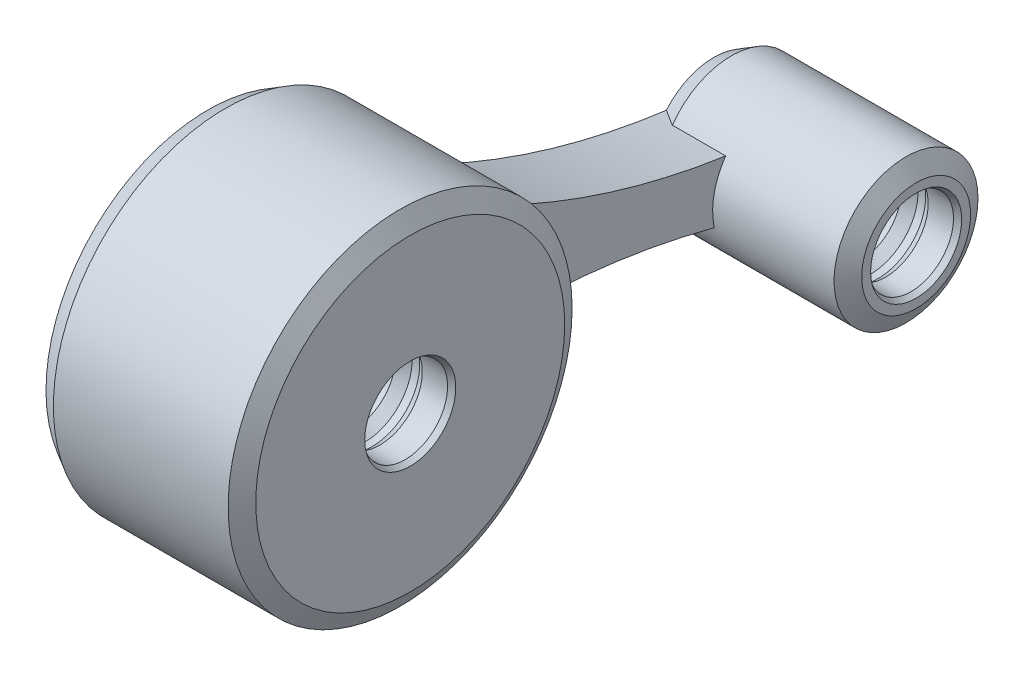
from build123d import *
from OCP.BRepFilletAPI import BRepFilletAPI_MakeChamfer

# Parameters (mm, degrees)
SKETCH1_R           = 7.114232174
BOSS_EXTRUDE1_DEPTH = 20
SKETCH2_R           = 17
BOSS_EXTRUDE2_DEPTH = 20
CHAMFER2_SIZE       = 1
CHAMFER2_SIZE2      = 1.732050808
CHAMFER3_SIZE       = 1
CHAMFER3_SIZE2      = 1.732050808
BOSS_EXTRUDE4_DEPTH = 7


with BuildPart() as part:
    # Sketch1 → Boss-Extrude1 (new body)
    with BuildSketch(Plane(origin=(0, 0, 0), x_dir=(0, 0, -1), z_dir=(1, 0, 0))):
        Circle(SKETCH1_R)
    extrude(amount=BOSS_EXTRUDE1_DEPTH)

    # Chamfer3: one chamfer whose edges measure the first distance from different faces: ONE call of the kernel's chamfer builder (chamfer() names one face for all edges)
    chamfer3_edges_1 = [part.edges().sort_by_distance(p)[0] for p in [
        (0, 0, 7.114232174),
    ]]
    chamfer3_side_1 = [part.faces().sort_by_distance(p)[0] for p in [
        (0, 0, 0),
    ]]
    chamfer3_edges_2 = [part.edges().sort_by_distance(p)[0] for p in [
        (20, 0, 7.114232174),
    ]]
    chamfer3_side_2 = [part.faces().sort_by_distance(p)[0] for p in [
        (10, 0, 7.114232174),
    ]]
    chamfer3 = BRepFilletAPI_MakeChamfer(part.part.solid().wrapped)
    for e in chamfer3_edges_1:
        chamfer3.Add(CHAMFER3_SIZE, CHAMFER3_SIZE2, e.wrapped, chamfer3_side_1[0].wrapped)  # the first distance lies on this face
    for e in chamfer3_edges_2:
        chamfer3.Add(CHAMFER3_SIZE, CHAMFER3_SIZE2, e.wrapped, chamfer3_side_2[0].wrapped)  # the first distance lies on this face
    add(Compound.cast(chamfer3.Shape()), mode=Mode.REPLACE)



with BuildPart() as body_2:
    # Sketch2 → Boss-Extrude2 (new body)
    with BuildSketch(Plane(origin=(0, 0, 0), x_dir=(0, 0, -1), z_dir=(1, 0, 0))):
        with Locations((-50, 10.619084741)):
            Circle(SKETCH2_R)
    extrude(amount=BOSS_EXTRUDE2_DEPTH)

    # Chamfer2: one chamfer whose edges measure the first distance from different faces: ONE call of the kernel's chamfer builder (chamfer() names one face for all edges)
    chamfer2_edges_1 = [body_2.edges().sort_by_distance(p)[0] for p in [
        (0, 10.619084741, 67),
    ]]
    chamfer2_side_1 = [body_2.faces().sort_by_distance(p)[0] for p in [
        (0, 10.619084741, 50),
    ]]
    chamfer2_edges_2 = [body_2.edges().sort_by_distance(p)[0] for p in [
        (20, 10.619084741, 67),
    ]]
    chamfer2_side_2 = [body_2.faces().sort_by_distance(p)[0] for p in [
        (10, 10.619084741, 67),
    ]]
    chamfer2 = BRepFilletAPI_MakeChamfer(body_2.part.solid().wrapped)
    for e in chamfer2_edges_1:
        chamfer2.Add(CHAMFER2_SIZE, CHAMFER2_SIZE2, e.wrapped, chamfer2_side_1[0].wrapped)  # the first distance lies on this face
    for e in chamfer2_edges_2:
        chamfer2.Add(CHAMFER2_SIZE, CHAMFER2_SIZE2, e.wrapped, chamfer2_side_2[0].wrapped)  # the first distance lies on this face
    add(Compound.cast(chamfer2.Shape()), mode=Mode.REPLACE)


with BuildPart() as part_1:
    add(part.part)

    add(body_2.part)  # Boss-Extrude4 merges body 2
    # Sketch5 → Boss-Extrude4 (add)
    with BuildSketch(Plane(origin=(0, 0, 0), x_dir=(0, 0, -1), z_dir=(1, 0, 0))):
        with BuildLine():
            ThreePointArc((-42.301718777, 20.107354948), (-61.929065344, 13.262606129), (-47.030841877, -1.233126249))
            ThreePointArc((-47.030841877, -1.233126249), (-23.933148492, 1.099326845), (-1.131405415, -3.262357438))
            ThreePointArc((-1.131405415, -3.262357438), (3.384480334, -0.684358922), (0.224985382, 3.445640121))
            ThreePointArc((0.224985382, 3.445640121), (-22.33245099, 8.473527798), (-42.301718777, 20.107354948))
        make_face()
    extrude(amount=BOSS_EXTRUDE4_DEPTH)

    # Sketch9 → Cut-Revolve1 (revolve, cut)
    with BuildSketch(Plane(origin=(0, 0, 0), x_dir=(-1, 0, 0), z_dir=(0, 0.9781823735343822, -0.20774803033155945)), mode=Mode.PRIVATE) as cut_revolve1_sk:
        Polygon((0, 46.615212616), (0, 51.115212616), (-6, 51.115212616), (-6, 47.123570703), (-5.46562, 47.123570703), (-4.5, 46.423570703), (-3.75, 46.423570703), (-3, 46.923570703), (-0.5, 46.923570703), align=None)
    cut_revolve1 = revolve(cut_revolve1_sk.sketch.rotate(Axis((0, 10.619084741, 50), (1, 0, 0)), 191.990413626), axis=Axis((0, 10.619084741, 50), (1, 0, 0)), mode=Mode.SUBTRACT)

    # Sketch13 → Cut-Revolve2 (revolve, cut)
    with BuildSketch(Plane(origin=(0, 0, 0), x_dir=(-1, 0, 0), z_dir=(0, 0.9781823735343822, -0.20774803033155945)), mode=Mode.PRIVATE) as cut_revolve2_sk:
        Polygon((0, -4.5), (0, 0), (-6, 0), (-6, -3.991641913), (-5.46562, -3.991641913), (-4.5, -4.691641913), (-3.75, -4.691641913), (-3, -4.191641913), (-0.5, -4.191641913), align=None)
    cut_revolve2 = revolve(cut_revolve2_sk.sketch.rotate(Axis((0, 0, 0), (1, 0, 0)), 191.990413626), axis=Axis((0, 0, 0), (1, 0, 0)), mode=Mode.SUBTRACT)

    # Mirror1: Cut-Revolve1, Cut-Revolve2 across plane
    add(cut_revolve1.mirror(Plane(origin=(10, 0, 0), x_dir=(0, 0, 1), z_dir=(1, 0, 0))), mode=Mode.SUBTRACT)
    add(cut_revolve2.mirror(Plane(origin=(10, 0, 0), x_dir=(0, 0, 1), z_dir=(1, 0, 0))), mode=Mode.SUBTRACT)


solid = part_1.part
